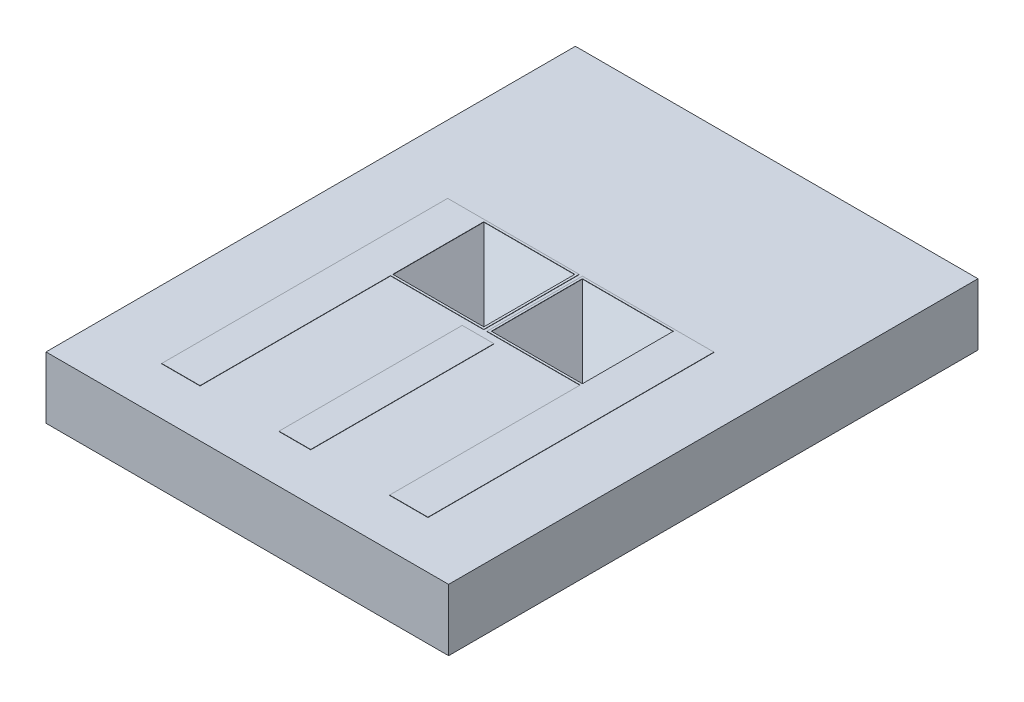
from build123d import *

# Parameters (mm, degrees)
SKETCH1_W               = 3.2258
SKETCH1_H               = 4.2418
SI_CHIP_DEPTH           = 0.4953
SKETCH2_W               = 0.72898
SKETCH2_H               = 0.72898
TCHED_RECESS_DEPTH      = 0.4826
TCHED_RECESS_DRAFT      = -32
SKETCH3_W               = 0.72898
SKETCH3_H               = 0.72898
SKETCH3_W_2             = 0.127
SKETCH3_H_2             = 1.46812
PLATED_CONTACTS_DEPTH   = 0.00254
MIRROR1_COPY_1_SKETCH_W = 0.72898
MIRROR1_COPY_1_SKETCH_H = 0.72898
MIRROR1_COPY_1_DEPTH    = 0.4826
MIRROR1_COPY_1_DRAFT    = -32
SKETCH4_R               = 0.79375
EXTRUDE1_DEPTH          = 0.0254


with BuildPart() as part:
    # Sketch1 → Si Chip (new body)
    with BuildSketch(Plane(origin=(0, 0, 0), x_dir=(1, 0, 0), z_dir=(0, 1, 0))):
        with Locations((0, -2.1209)):
            Rectangle(SKETCH1_W, SKETCH1_H)
    extrude(amount=-SI_CHIP_DEPTH)


with BuildPart() as tched_recess_tool:
    # Sketch2 → tched recess (with draft: the straight prism first)
    with BuildSketch(Plane(origin=(0, 0, 0), x_dir=(1, 0, 0), z_dir=(0, 1, 0))):
        with Locations((-0.39497, -1.95199)):
            Rectangle(SKETCH2_W, SKETCH2_H)
    extrude(amount=-TCHED_RECESS_DEPTH)
    # tched recess: the draft: its side faces are tilted about the plane it starts from
    tched_recess_sides = [tched_recess_tool.faces().sort_by_distance(p)[0] for p in [
        (-0.75946, -0.2413, 1.95199),
        (-0.39497, -0.2413, 2.31648),
        (-0.03048, -0.2413, 1.95199),
        (-0.39497, -0.2413, 1.5875),
    ]]
    draft(tched_recess_sides, Plane(origin=(0, 0, 0), x_dir=(1, 0, 0), z_dir=(0, 1, 0)), TCHED_RECESS_DRAFT)


with BuildPart() as part_1:
    add(part.part)

    # tched recess: cut by tched_recess_tool
    add(tched_recess_tool.part, mode=Mode.SUBTRACT)

    # Sketch3 → Plated contacts (add)
    # profile 1 of 2: a face of its own
    with BuildSketch(Plane(origin=(0, 0, 0), x_dir=(1, 0, 0), z_dir=(0, 1, 0))):
        Polygon((-1.0668, -3.8608), (-0.75946, -3.8608), (-0.75946, -2.33426), (-0.0127, -2.33426), (-0.0127, -1.56972), (-1.0668, -1.56972), align=None)
        with Locations((-0.39497, -1.95199)):
            Rectangle(SKETCH3_W, SKETCH3_H, mode=Mode.SUBTRACT)
    # profile 2 of 2: a face of its own
    with BuildSketch(Plane(origin=(0, 0, 0), x_dir=(1, 0, 0), z_dir=(0, 1, 0))):
        with Locations((-0.0635, -3.12674)):
            Rectangle(SKETCH3_W_2, SKETCH3_H_2)
    plated_contacts = extrude(amount=PLATED_CONTACTS_DEPTH)

    # Mirror1: Plated contacts across plane
    add(plated_contacts.mirror(Plane(origin=(0, 0, 0), x_dir=(0, 0, 1), z_dir=(1, 0, 0))))


with BuildPart() as mirror1_copy_1_tool:
    # Mirror1 copy 1 sketch → Mirror1 copy 1 (with draft: the straight prism first)
    with BuildSketch(Plane(origin=(0, 0, 0), x_dir=(-1, 0, 0), z_dir=(0, 1, 0))):
        with Locations((-0.39497, 1.95199)):
            Rectangle(MIRROR1_COPY_1_SKETCH_W, MIRROR1_COPY_1_SKETCH_H)
    extrude(amount=-MIRROR1_COPY_1_DEPTH)
    # Mirror1 copy 1: the draft: its side faces are tilted about the plane it starts from
    mirror1_copy_1_sides = [mirror1_copy_1_tool.faces().sort_by_distance(p)[0] for p in [
        (0.75946, -0.2413, 1.95199),
        (0.39497, -0.2413, 2.31648),
        (0.03048, -0.2413, 1.95199),
        (0.39497, -0.2413, 1.5875),
    ]]
    draft(mirror1_copy_1_sides, Plane(origin=(0, 0, 0), x_dir=(-1, 0, 0), z_dir=(0, 1, 0)), MIRROR1_COPY_1_DRAFT)


with BuildPart() as part_2:
    add(part_1.part)

    # Mirror1 copy 1: cut by mirror1_copy_1_tool
    add(mirror1_copy_1_tool.part, mode=Mode.SUBTRACT)

    # Sketch4 → Extrude1 (add)
    with BuildSketch(Plane.XZ.offset(0.4953)):
        with Locations(Location((0, 2.1209, 0), (0, 0, 90))):
            Circle(SKETCH4_R)
    extrude(amount=EXTRUDE1_DEPTH)


solid = part_2.part
